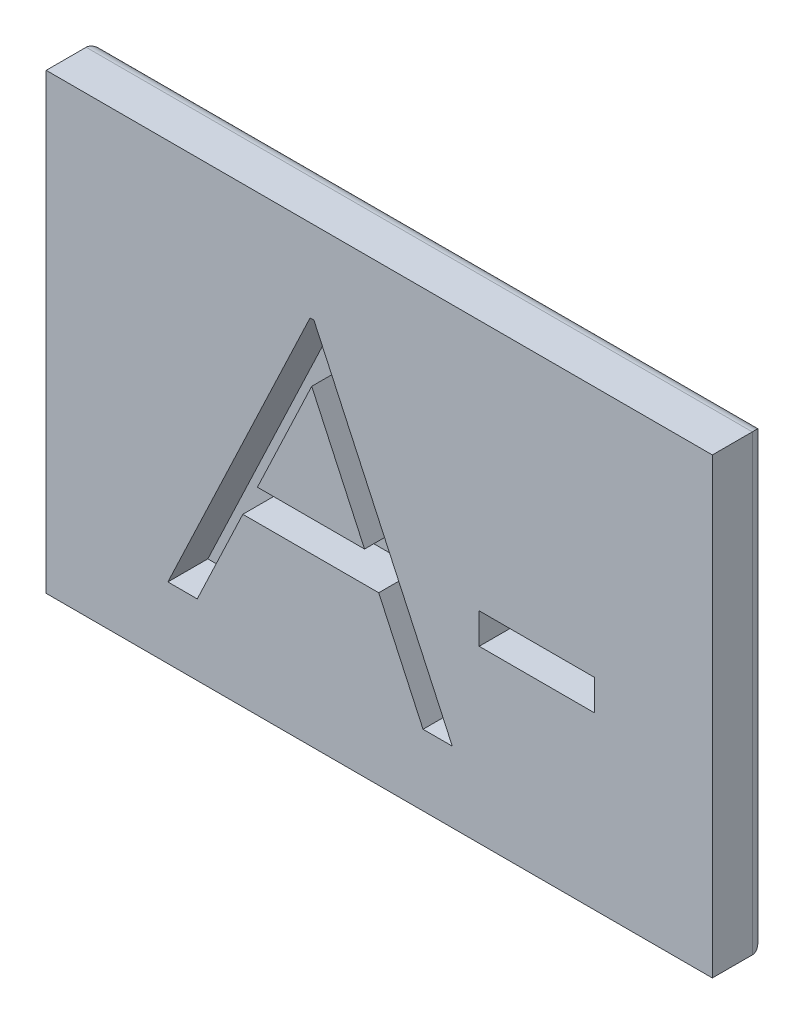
ISO-10303-21;
HEADER;
FILE_DESCRIPTION(('STEP AP214'),'2;1');
FILE_NAME('part.step','',(''),(''),'','','');
FILE_SCHEMA(('AUTOMOTIVE_DESIGN { 1 0 10303 214 1 1 1 1 }'));
ENDSEC;
DATA;
#1=APPLICATION_CONTEXT('core data for automotive mechanical design processes');
#2=APPLICATION_PROTOCOL_DEFINITION('international standard','automotive_design',2000,#1);
#3=PRODUCT_CONTEXT('',#1,'mechanical');
#4=PRODUCT('Part','Part','',(#3));
#5=PRODUCT_RELATED_PRODUCT_CATEGORY('part','',(#4));
#6=PRODUCT_DEFINITION_FORMATION('','',#4);
#7=PRODUCT_DEFINITION_CONTEXT('part definition',#1,'design');
#8=PRODUCT_DEFINITION('design','',#6,#7);
#9=PRODUCT_DEFINITION_SHAPE('','',#8);
#10=(LENGTH_UNIT() NAMED_UNIT(*) SI_UNIT(.MILLI.,.METRE.));
#11=(NAMED_UNIT(*) PLANE_ANGLE_UNIT() SI_UNIT($,.RADIAN.));
#12=(NAMED_UNIT(*) SI_UNIT($,.STERADIAN.) SOLID_ANGLE_UNIT());
#13=UNCERTAINTY_MEASURE_WITH_UNIT(LENGTH_MEASURE(1.E-05),#10,'distance_accuracy_value','');
#14=(GEOMETRIC_REPRESENTATION_CONTEXT(3) GLOBAL_UNCERTAINTY_ASSIGNED_CONTEXT((#13)) GLOBAL_UNIT_ASSIGNED_CONTEXT((#10,
#11,#12)) REPRESENTATION_CONTEXT('',''));
#15=CARTESIAN_POINT('',(0.,0.,0.));
#16=DIRECTION('',(0.,0.,1.));
#17=DIRECTION('',(1.,0.,0.));
#18=AXIS2_PLACEMENT_3D('',#15,#16,#17);
#19=CARTESIAN_POINT('',(0.,0.,2.54));
#20=DIRECTION('',(0.,0.,-1.));
#21=DIRECTION('',(-1.,0.,0.));
#22=AXIS2_PLACEMENT_3D('',#19,#20,#21);
#23=PLANE('',#22);
#24=DIRECTION('',(0.,1.,0.));
#25=VECTOR('',#24,1.);
#26=CARTESIAN_POINT('',(4.7625,-2.66023079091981,2.54));
#27=LINE('',#26,#25);
#28=CARTESIAN_POINT('',(4.7625,-2.66023079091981,2.54));
#29=VERTEX_POINT('',#28);
#30=CARTESIAN_POINT('',(4.7625,-1.19484617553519,2.54));
#31=VERTEX_POINT('',#30);
#32=EDGE_CURVE('E322',#29,#31,#27,.T.);
#33=ORIENTED_EDGE('',*,*,#32,.T.);
#34=DIRECTION('',(1.,0.,0.));
#35=VECTOR('',#34,1.);
#36=CARTESIAN_POINT('',(4.7625,-1.19484617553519,2.54));
#37=LINE('',#36,#35);
#38=CARTESIAN_POINT('',(10.2576923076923,-1.19484617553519,2.54));
#39=VERTEX_POINT('',#38);
#40=EDGE_CURVE('E326',#31,#39,#37,.T.);
#41=ORIENTED_EDGE('',*,*,#40,.T.);
#42=DIRECTION('',(0.,-1.,0.));
#43=VECTOR('',#42,1.);
#44=CARTESIAN_POINT('',(10.2576923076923,-1.19484617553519,2.54));
#45=LINE('',#44,#43);
#46=CARTESIAN_POINT('',(10.2576923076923,-2.66023079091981,2.54));
#47=VERTEX_POINT('',#46);
#48=EDGE_CURVE('E330',#39,#47,#45,.T.);
#49=ORIENTED_EDGE('',*,*,#48,.T.);
#50=DIRECTION('',(-1.,0.,0.));
#51=VECTOR('',#50,1.);
#52=CARTESIAN_POINT('',(10.2576923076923,-2.66023079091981,2.54));
#53=LINE('',#52,#51);
#54=EDGE_CURVE('E312',#47,#29,#53,.T.);
#55=ORIENTED_EDGE('',*,*,#54,.T.);
#56=EDGE_LOOP('',(#33,#41,#49,#55));
#57=FACE_BOUND('',#56,.T.);
#58=DIRECTION('',(0.,1.,0.));
#59=VECTOR('',#58,1.);
#60=CARTESIAN_POINT('',(15.875,-10.795,2.54));
#61=LINE('',#60,#59);
#62=CARTESIAN_POINT('',(15.875,-10.795,2.54));
#63=VERTEX_POINT('',#62);
#64=CARTESIAN_POINT('',(15.875,10.795,2.54));
#65=VERTEX_POINT('',#64);
#66=EDGE_CURVE('E349',#63,#65,#61,.T.);
#67=ORIENTED_EDGE('',*,*,#66,.T.);
#68=DIRECTION('',(-1.,0.,0.));
#69=VECTOR('',#68,1.);
#70=CARTESIAN_POINT('',(-15.875,10.795,2.54));
#71=LINE('',#70,#69);
#72=CARTESIAN_POINT('',(-15.875,10.795,2.54));
#73=VERTEX_POINT('',#72);
#74=EDGE_CURVE('E353',#65,#73,#71,.T.);
#75=ORIENTED_EDGE('',*,*,#74,.T.);
#76=DIRECTION('',(0.,-1.,0.));
#77=VECTOR('',#76,1.);
#78=CARTESIAN_POINT('',(-15.875,-10.795,2.54));
#79=LINE('',#78,#77);
#80=CARTESIAN_POINT('',(-15.875,-10.795,2.54));
#81=VERTEX_POINT('',#80);
#82=EDGE_CURVE('E356',#73,#81,#79,.T.);
#83=ORIENTED_EDGE('',*,*,#82,.T.);
#84=DIRECTION('',(1.,0.,0.));
#85=VECTOR('',#84,1.);
#86=CARTESIAN_POINT('',(-15.875,-10.795,2.54));
#87=LINE('',#86,#85);
#88=EDGE_CURVE('E359',#81,#63,#87,.T.);
#89=ORIENTED_EDGE('',*,*,#88,.T.);
#90=EDGE_LOOP('',(#67,#75,#83,#89));
#91=FACE_BOUND('',#90,.T.);
#92=DIRECTION('',(1.,0.,0.));
#93=VECTOR('',#92,1.);
#94=CARTESIAN_POINT('',(-3.29711538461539,6.86476920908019,2.54));
#95=LINE('',#94,#93);
#96=CARTESIAN_POINT('',(-3.29711538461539,6.86476920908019,2.54));
#97=VERTEX_POINT('',#96);
#98=CARTESIAN_POINT('',(-3.11394230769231,6.86476920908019,2.54));
#99=VERTEX_POINT('',#98);
#100=EDGE_CURVE('E56',#97,#99,#95,.T.);
#101=ORIENTED_EDGE('',*,*,#100,.T.);
#102=DIRECTION('',(0.419058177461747,-0.907959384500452,0.));
#103=VECTOR('',#102,1.);
#104=CARTESIAN_POINT('',(-3.11394230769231,6.86476920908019,2.54));
#105=LINE('',#104,#103);
#106=CARTESIAN_POINT('',(3.48028846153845,-7.42273079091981,2.54));
#107=VERTEX_POINT('',#106);
#108=EDGE_CURVE('E256',#99,#107,#105,.T.);
#109=ORIENTED_EDGE('',*,*,#108,.T.);
#110=DIRECTION('',(-1.,0.,0.));
#111=VECTOR('',#110,1.);
#112=CARTESIAN_POINT('',(3.48028846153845,-7.42273079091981,2.54));
#113=LINE('',#112,#111);
#114=CARTESIAN_POINT('',(2.08645582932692,-7.42273079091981,2.54));
#115=VERTEX_POINT('',#114);
#116=EDGE_CURVE('E260',#107,#115,#113,.T.);
#117=ORIENTED_EDGE('',*,*,#116,.T.);
#118=DIRECTION('',(-0.418842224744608,0.908059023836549,0.));
#119=VECTOR('',#118,1.);
#120=CARTESIAN_POINT('',(2.08645582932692,-7.42273079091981,2.54));
#121=LINE('',#120,#119);
#122=CARTESIAN_POINT('',(-0.025758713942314,-2.84340386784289,2.54));
#123=VERTEX_POINT('',#122);
#124=EDGE_CURVE('E264',#115,#123,#121,.T.);
#125=ORIENTED_EDGE('',*,*,#124,.T.);
#126=DIRECTION('',(-1.,0.,0.));
#127=VECTOR('',#126,1.);
#128=CARTESIAN_POINT('',(-0.025758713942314,-2.84340386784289,2.54));
#129=LINE('',#128,#127);
#130=CARTESIAN_POINT('',(-6.50264423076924,-2.84340386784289,2.54));
#131=VERTEX_POINT('',#130);
#132=EDGE_CURVE('E268',#123,#131,#129,.T.);
#133=ORIENTED_EDGE('',*,*,#132,.T.);
#134=DIRECTION('',(-0.428596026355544,-0.903496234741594,0.));
#135=VECTOR('',#134,1.);
#136=CARTESIAN_POINT('',(-6.50264423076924,-2.84340386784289,2.54));
#137=LINE('',#136,#135);
#138=CARTESIAN_POINT('',(-8.67496243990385,-7.42273079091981,2.54));
#139=VERTEX_POINT('',#138);
#140=EDGE_CURVE('E272',#131,#139,#137,.T.);
#141=ORIENTED_EDGE('',*,*,#140,.T.);
#142=DIRECTION('',(-1.,0.,0.));
#143=VECTOR('',#142,1.);
#144=CARTESIAN_POINT('',(-8.67496243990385,-7.42273079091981,2.54));
#145=LINE('',#144,#143);
#146=CARTESIAN_POINT('',(-10.0745192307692,-7.42273079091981,2.54));
#147=VERTEX_POINT('',#146);
#148=EDGE_CURVE('E276',#139,#147,#145,.T.);
#149=ORIENTED_EDGE('',*,*,#148,.T.);
#150=DIRECTION('',(0.428584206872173,0.903501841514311,0.));
#151=VECTOR('',#150,1.);
#152=CARTESIAN_POINT('',(-10.0745192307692,-7.42273079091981,2.54));
#153=LINE('',#152,#151);
#154=EDGE_CURVE('E232',#147,#97,#153,.T.);
#155=ORIENTED_EDGE('',*,*,#154,.T.);
#156=EDGE_LOOP('',(#101,#109,#117,#125,#133,#141,#149,#155));
#157=FACE_BOUND('',#156,.T.);
#158=ADVANCED_FACE('F38',(#57,#91,#157),#23,.F.);
#159=CARTESIAN_POINT('',(15.875,-10.795,2.54));
#160=DIRECTION('',(-1.,0.,0.));
#161=DIRECTION('',(0.,0.,1.));
#162=AXIS2_PLACEMENT_3D('',#159,#160,#161);
#163=PLANE('',#162);
#164=DIRECTION('',(0.,0.,-1.));
#165=VECTOR('',#164,1.);
#166=CARTESIAN_POINT('',(15.875,-10.795,2.54));
#167=LINE('',#166,#165);
#168=CARTESIAN_POINT('',(15.875,-10.795,0.635));
#169=VERTEX_POINT('',#168);
#170=EDGE_CURVE('E362',#63,#169,#167,.T.);
#171=ORIENTED_EDGE('',*,*,#170,.T.);
#172=DIRECTION('',(0.,1.,0.));
#173=VECTOR('',#172,1.);
#174=CARTESIAN_POINT('',(15.875,10.795,0.635));
#175=LINE('',#174,#173);
#176=CARTESIAN_POINT('',(15.875,10.795,0.635));
#177=VERTEX_POINT('',#176);
#178=EDGE_CURVE('E11',#169,#177,#175,.T.);
#179=ORIENTED_EDGE('',*,*,#178,.T.);
#180=DIRECTION('',(0.,0.,-1.));
#181=VECTOR('',#180,1.);
#182=CARTESIAN_POINT('',(15.875,10.795,2.54));
#183=LINE('',#182,#181);
#184=EDGE_CURVE('E374',#65,#177,#183,.T.);
#185=ORIENTED_EDGE('',*,*,#184,.F.);
#186=ORIENTED_EDGE('',*,*,#66,.F.);
#187=EDGE_LOOP('',(#171,#179,#185,#186));
#188=FACE_BOUND('',#187,.T.);
#189=ADVANCED_FACE('F446',(#188),#163,.F.);
#190=CARTESIAN_POINT('',(-15.875,10.795,2.54));
#191=DIRECTION('',(0.,-1.,0.));
#192=DIRECTION('',(0.,0.,-1.));
#193=AXIS2_PLACEMENT_3D('',#190,#191,#192);
#194=PLANE('',#193);
#195=ORIENTED_EDGE('',*,*,#184,.T.);
#196=DIRECTION('',(-1.,0.,0.));
#197=VECTOR('',#196,1.);
#198=CARTESIAN_POINT('',(-15.875,10.795,0.635));
#199=LINE('',#198,#197);
#200=CARTESIAN_POINT('',(-15.875,10.795,0.635));
#201=VERTEX_POINT('',#200);
#202=EDGE_CURVE('E48',#177,#201,#199,.T.);
#203=ORIENTED_EDGE('',*,*,#202,.T.);
#204=DIRECTION('',(0.,0.,-1.));
#205=VECTOR('',#204,1.);
#206=CARTESIAN_POINT('',(-15.875,10.795,2.54));
#207=LINE('',#206,#205);
#208=EDGE_CURVE('E370',#73,#201,#207,.T.);
#209=ORIENTED_EDGE('',*,*,#208,.F.);
#210=ORIENTED_EDGE('',*,*,#74,.F.);
#211=EDGE_LOOP('',(#195,#203,#209,#210));
#212=FACE_BOUND('',#211,.T.);
#213=ADVANCED_FACE('F444',(#212),#194,.F.);
#214=CARTESIAN_POINT('',(-15.875,-10.795,2.54));
#215=DIRECTION('',(1.,0.,0.));
#216=DIRECTION('',(0.,0.,-1.));
#217=AXIS2_PLACEMENT_3D('',#214,#215,#216);
#218=PLANE('',#217);
#219=ORIENTED_EDGE('',*,*,#208,.T.);
#220=DIRECTION('',(0.,-1.,0.));
#221=VECTOR('',#220,1.);
#222=CARTESIAN_POINT('',(-15.875,-10.795,0.635));
#223=LINE('',#222,#221);
#224=CARTESIAN_POINT('',(-15.875,-10.795,0.635));
#225=VERTEX_POINT('',#224);
#226=EDGE_CURVE('E378',#201,#225,#223,.T.);
#227=ORIENTED_EDGE('',*,*,#226,.T.);
#228=DIRECTION('',(0.,0.,-1.));
#229=VECTOR('',#228,1.);
#230=CARTESIAN_POINT('',(-15.875,-10.795,2.54));
#231=LINE('',#230,#229);
#232=EDGE_CURVE('E366',#81,#225,#231,.T.);
#233=ORIENTED_EDGE('',*,*,#232,.F.);
#234=ORIENTED_EDGE('',*,*,#82,.F.);
#235=EDGE_LOOP('',(#219,#227,#233,#234));
#236=FACE_BOUND('',#235,.T.);
#237=ADVANCED_FACE('F434',(#236),#218,.F.);
#238=CARTESIAN_POINT('',(-15.875,-10.795,2.54));
#239=DIRECTION('',(0.,1.,0.));
#240=DIRECTION('',(0.,0.,1.));
#241=AXIS2_PLACEMENT_3D('',#238,#239,#240);
#242=PLANE('',#241);
#243=ORIENTED_EDGE('',*,*,#232,.T.);
#244=DIRECTION('',(1.,0.,0.));
#245=VECTOR('',#244,1.);
#246=CARTESIAN_POINT('',(15.875,-10.795,0.635));
#247=LINE('',#246,#245);
#248=EDGE_CURVE('E395',#225,#169,#247,.T.);
#249=ORIENTED_EDGE('',*,*,#248,.T.);
#250=ORIENTED_EDGE('',*,*,#170,.F.);
#251=ORIENTED_EDGE('',*,*,#88,.F.);
#252=EDGE_LOOP('',(#243,#249,#250,#251));
#253=FACE_BOUND('',#252,.T.);
#254=ADVANCED_FACE('F438',(#253),#242,.F.);
#255=CARTESIAN_POINT('',(0.,0.,0.));
#256=DIRECTION('',(0.,0.,-1.));
#257=DIRECTION('',(-1.,0.,0.));
#258=AXIS2_PLACEMENT_3D('',#255,#256,#257);
#259=PLANE('',#258);
#260=DIRECTION('',(1.,0.,0.));
#261=VECTOR('',#260,1.);
#262=CARTESIAN_POINT('',(-15.875,-10.16,0.));
#263=LINE('',#262,#261);
#264=CARTESIAN_POINT('',(15.24,-10.16,0.));
#265=VERTEX_POINT('',#264);
#266=CARTESIAN_POINT('',(-15.24,-10.16,0.));
#267=VERTEX_POINT('',#266);
#268=EDGE_CURVE('E388',#265,#267,#263,.F.);
#269=ORIENTED_EDGE('',*,*,#268,.T.);
#270=DIRECTION('',(0.,-1.,0.));
#271=VECTOR('',#270,1.);
#272=CARTESIAN_POINT('',(-15.24,10.795,0.));
#273=LINE('',#272,#271);
#274=CARTESIAN_POINT('',(-15.24,10.16,0.));
#275=VERTEX_POINT('',#274);
#276=EDGE_CURVE('E391',#267,#275,#273,.F.);
#277=ORIENTED_EDGE('',*,*,#276,.T.);
#278=DIRECTION('',(-1.,0.,0.));
#279=VECTOR('',#278,1.);
#280=CARTESIAN_POINT('',(15.875,10.16,0.));
#281=LINE('',#280,#279);
#282=CARTESIAN_POINT('',(15.24,10.16,0.));
#283=VERTEX_POINT('',#282);
#284=EDGE_CURVE('E385',#275,#283,#281,.F.);
#285=ORIENTED_EDGE('',*,*,#284,.T.);
#286=DIRECTION('',(0.,1.,0.));
#287=VECTOR('',#286,1.);
#288=CARTESIAN_POINT('',(15.24,-10.795,0.));
#289=LINE('',#288,#287);
#290=EDGE_CURVE('E382',#283,#265,#289,.F.);
#291=ORIENTED_EDGE('',*,*,#290,.T.);
#292=EDGE_LOOP('',(#269,#277,#285,#291));
#293=FACE_BOUND('',#292,.T.);
#294=ADVANCED_FACE('F423',(#293),#259,.T.);
#295=CARTESIAN_POINT('',(15.24,-10.795,0.635));
#296=DIRECTION('',(0.,-1.,0.));
#297=DIRECTION('',(0.,0.,-1.));
#298=AXIS2_PLACEMENT_3D('',#295,#296,#297);
#299=CYLINDRICAL_SURFACE('',#298,0.635);
#300=CARTESIAN_POINT('',(15.24,-10.16,0.635));
#301=DIRECTION('',(-0.707106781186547,-0.707106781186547,0.));
#302=DIRECTION('',(0.707106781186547,-0.707106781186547,0.));
#303=AXIS2_PLACEMENT_3D('',#300,#301,#302);
#304=ELLIPSE('',#303,0.898025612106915,0.635);
#305=EDGE_CURVE('E404',#265,#169,#304,.T.);
#306=ORIENTED_EDGE('',*,*,#305,.F.);
#307=ORIENTED_EDGE('',*,*,#290,.F.);
#308=CARTESIAN_POINT('',(15.24,10.16,0.635));
#309=DIRECTION('',(0.707106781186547,-0.707106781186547,0.));
#310=DIRECTION('',(-0.707106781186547,-0.707106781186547,0.));
#311=AXIS2_PLACEMENT_3D('',#308,#309,#310);
#312=ELLIPSE('',#311,0.898025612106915,0.635);
#313=EDGE_CURVE('E42',#177,#283,#312,.F.);
#314=ORIENTED_EDGE('',*,*,#313,.F.);
#315=ORIENTED_EDGE('',*,*,#178,.F.);
#316=EDGE_LOOP('',(#306,#307,#314,#315));
#317=FACE_BOUND('',#316,.T.);
#318=ADVANCED_FACE('F40',(#317),#299,.T.);
#319=CARTESIAN_POINT('',(-15.875,10.16,0.635));
#320=DIRECTION('',(1.,0.,0.));
#321=DIRECTION('',(0.,0.,-1.));
#322=AXIS2_PLACEMENT_3D('',#319,#320,#321);
#323=CYLINDRICAL_SURFACE('',#322,0.635);
#324=ORIENTED_EDGE('',*,*,#313,.T.);
#325=ORIENTED_EDGE('',*,*,#284,.F.);
#326=CARTESIAN_POINT('',(-15.24,10.16,0.635));
#327=DIRECTION('',(0.707106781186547,0.707106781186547,0.));
#328=DIRECTION('',(0.707106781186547,-0.707106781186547,0.));
#329=AXIS2_PLACEMENT_3D('',#326,#327,#328);
#330=ELLIPSE('',#329,0.898025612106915,0.635);
#331=EDGE_CURVE('E402',#201,#275,#330,.F.);
#332=ORIENTED_EDGE('',*,*,#331,.F.);
#333=ORIENTED_EDGE('',*,*,#202,.F.);
#334=EDGE_LOOP('',(#324,#325,#332,#333));
#335=FACE_BOUND('',#334,.T.);
#336=ADVANCED_FACE('F417',(#335),#323,.T.);
#337=CARTESIAN_POINT('',(-15.875,-10.16,0.635));
#338=DIRECTION('',(-1.,0.,0.));
#339=DIRECTION('',(0.,0.,1.));
#340=AXIS2_PLACEMENT_3D('',#337,#338,#339);
#341=CYLINDRICAL_SURFACE('',#340,0.635);
#342=ORIENTED_EDGE('',*,*,#305,.T.);
#343=ORIENTED_EDGE('',*,*,#248,.F.);
#344=CARTESIAN_POINT('',(-15.24,-10.16,0.635));
#345=DIRECTION('',(-0.707106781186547,0.707106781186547,0.));
#346=DIRECTION('',(-0.707106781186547,-0.707106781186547,0.));
#347=AXIS2_PLACEMENT_3D('',#344,#345,#346);
#348=ELLIPSE('',#347,0.898025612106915,0.635);
#349=EDGE_CURVE('E306',#267,#225,#348,.T.);
#350=ORIENTED_EDGE('',*,*,#349,.F.);
#351=ORIENTED_EDGE('',*,*,#268,.F.);
#352=EDGE_LOOP('',(#342,#343,#350,#351));
#353=FACE_BOUND('',#352,.T.);
#354=ADVANCED_FACE('F429',(#353),#341,.T.);
#355=CARTESIAN_POINT('',(-15.24,-10.795,0.635));
#356=DIRECTION('',(0.,1.,0.));
#357=DIRECTION('',(0.,0.,1.));
#358=AXIS2_PLACEMENT_3D('',#355,#356,#357);
#359=CYLINDRICAL_SURFACE('',#358,0.635);
#360=ORIENTED_EDGE('',*,*,#331,.T.);
#361=ORIENTED_EDGE('',*,*,#276,.F.);
#362=ORIENTED_EDGE('',*,*,#349,.T.);
#363=ORIENTED_EDGE('',*,*,#226,.F.);
#364=EDGE_LOOP('',(#360,#361,#362,#363));
#365=FACE_BOUND('',#364,.T.);
#366=ADVANCED_FACE('F427',(#365),#359,.T.);
#367=CARTESIAN_POINT('',(4.7625,-2.66023079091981,0.635));
#368=DIRECTION('',(1.,0.,0.));
#369=DIRECTION('',(0.,0.,-1.));
#370=AXIS2_PLACEMENT_3D('',#367,#368,#369);
#371=PLANE('',#370);
#372=ORIENTED_EDGE('',*,*,#32,.F.);
#373=DIRECTION('',(0.,0.,1.));
#374=VECTOR('',#373,1.);
#375=CARTESIAN_POINT('',(4.7625,-2.66023079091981,0.635));
#376=LINE('',#375,#374);
#377=CARTESIAN_POINT('',(4.7625,-2.66023079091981,0.635));
#378=VERTEX_POINT('',#377);
#379=EDGE_CURVE('E321',#378,#29,#376,.T.);
#380=ORIENTED_EDGE('',*,*,#379,.F.);
#381=DIRECTION('',(0.,1.,0.));
#382=VECTOR('',#381,1.);
#383=CARTESIAN_POINT('',(4.7625,-2.66023079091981,0.635));
#384=LINE('',#383,#382);
#385=CARTESIAN_POINT('',(4.7625,-1.19484617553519,0.635));
#386=VERTEX_POINT('',#385);
#387=EDGE_CURVE('E307',#378,#386,#384,.T.);
#388=ORIENTED_EDGE('',*,*,#387,.T.);
#389=DIRECTION('',(0.,0.,1.));
#390=VECTOR('',#389,1.);
#391=CARTESIAN_POINT('',(4.7625,-1.19484617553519,0.635));
#392=LINE('',#391,#390);
#393=EDGE_CURVE('E220',#386,#31,#392,.T.);
#394=ORIENTED_EDGE('',*,*,#393,.T.);
#395=EDGE_LOOP('',(#372,#380,#388,#394));
#396=FACE_BOUND('',#395,.T.);
#397=ADVANCED_FACE('F461',(#396),#371,.T.);
#398=CARTESIAN_POINT('',(4.7625,-1.19484617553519,0.635));
#399=DIRECTION('',(0.,-1.,0.));
#400=DIRECTION('',(0.,0.,-1.));
#401=AXIS2_PLACEMENT_3D('',#398,#399,#400);
#402=PLANE('',#401);
#403=ORIENTED_EDGE('',*,*,#40,.F.);
#404=ORIENTED_EDGE('',*,*,#393,.F.);
#405=DIRECTION('',(1.,0.,0.));
#406=VECTOR('',#405,1.);
#407=CARTESIAN_POINT('',(4.7625,-1.19484617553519,0.635));
#408=LINE('',#407,#406);
#409=CARTESIAN_POINT('',(10.2576923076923,-1.19484617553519,0.635));
#410=VERTEX_POINT('',#409);
#411=EDGE_CURVE('E311',#386,#410,#408,.T.);
#412=ORIENTED_EDGE('',*,*,#411,.T.);
#413=DIRECTION('',(0.,0.,1.));
#414=VECTOR('',#413,1.);
#415=CARTESIAN_POINT('',(10.2576923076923,-1.19484617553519,0.635));
#416=LINE('',#415,#414);
#417=EDGE_CURVE('E343',#410,#39,#416,.T.);
#418=ORIENTED_EDGE('',*,*,#417,.T.);
#419=EDGE_LOOP('',(#403,#404,#412,#418));
#420=FACE_BOUND('',#419,.T.);
#421=ADVANCED_FACE('F524',(#420),#402,.T.);
#422=CARTESIAN_POINT('',(10.2576923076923,-1.19484617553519,0.635));
#423=DIRECTION('',(-1.,0.,0.));
#424=DIRECTION('',(0.,0.,1.));
#425=AXIS2_PLACEMENT_3D('',#422,#423,#424);
#426=PLANE('',#425);
#427=ORIENTED_EDGE('',*,*,#48,.F.);
#428=ORIENTED_EDGE('',*,*,#417,.F.);
#429=DIRECTION('',(0.,-1.,0.));
#430=VECTOR('',#429,1.);
#431=CARTESIAN_POINT('',(10.2576923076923,-1.19484617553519,0.635));
#432=LINE('',#431,#430);
#433=CARTESIAN_POINT('',(10.2576923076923,-2.66023079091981,0.635));
#434=VERTEX_POINT('',#433);
#435=EDGE_CURVE('E315',#410,#434,#432,.T.);
#436=ORIENTED_EDGE('',*,*,#435,.T.);
#437=DIRECTION('',(0.,0.,1.));
#438=VECTOR('',#437,1.);
#439=CARTESIAN_POINT('',(10.2576923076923,-2.66023079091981,0.635));
#440=LINE('',#439,#438);
#441=EDGE_CURVE('E340',#434,#47,#440,.T.);
#442=ORIENTED_EDGE('',*,*,#441,.T.);
#443=EDGE_LOOP('',(#427,#428,#436,#442));
#444=FACE_BOUND('',#443,.T.);
#445=ADVANCED_FACE('F533',(#444),#426,.T.);
#446=CARTESIAN_POINT('',(10.2576923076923,-2.66023079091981,0.635));
#447=DIRECTION('',(0.,1.,0.));
#448=DIRECTION('',(0.,0.,1.));
#449=AXIS2_PLACEMENT_3D('',#446,#447,#448);
#450=PLANE('',#449);
#451=ORIENTED_EDGE('',*,*,#54,.F.);
#452=ORIENTED_EDGE('',*,*,#441,.F.);
#453=DIRECTION('',(-1.,0.,0.));
#454=VECTOR('',#453,1.);
#455=CARTESIAN_POINT('',(10.2576923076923,-2.66023079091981,0.635));
#456=LINE('',#455,#454);
#457=EDGE_CURVE('E318',#434,#378,#456,.T.);
#458=ORIENTED_EDGE('',*,*,#457,.T.);
#459=ORIENTED_EDGE('',*,*,#379,.T.);
#460=EDGE_LOOP('',(#451,#452,#458,#459));
#461=FACE_BOUND('',#460,.T.);
#462=ADVANCED_FACE('F543',(#461),#450,.T.);
#463=CARTESIAN_POINT('',(0.,0.,0.635));
#464=DIRECTION('',(0.,0.,-1.));
#465=DIRECTION('',(-1.,0.,0.));
#466=AXIS2_PLACEMENT_3D('',#463,#464,#465);
#467=PLANE('',#466);
#468=ORIENTED_EDGE('',*,*,#387,.F.);
#469=ORIENTED_EDGE('',*,*,#457,.F.);
#470=ORIENTED_EDGE('',*,*,#435,.F.);
#471=ORIENTED_EDGE('',*,*,#411,.F.);
#472=EDGE_LOOP('',(#468,#469,#470,#471));
#473=FACE_BOUND('',#472,.T.);
#474=ADVANCED_FACE('F553',(#473),#467,.F.);
#475=CARTESIAN_POINT('',(-3.29711538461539,6.86476920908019,0.635));
#476=DIRECTION('',(0.,-1.,0.));
#477=DIRECTION('',(0.,0.,-1.));
#478=AXIS2_PLACEMENT_3D('',#475,#476,#477);
#479=PLANE('',#478);
#480=ORIENTED_EDGE('',*,*,#100,.F.);
#481=DIRECTION('',(0.,0.,1.));
#482=VECTOR('',#481,1.);
#483=CARTESIAN_POINT('',(-3.29711538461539,6.86476920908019,0.635));
#484=LINE('',#483,#482);
#485=CARTESIAN_POINT('',(-3.29711538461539,6.86476920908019,0.635));
#486=VERTEX_POINT('',#485);
#487=EDGE_CURVE('E253',#486,#97,#484,.T.);
#488=ORIENTED_EDGE('',*,*,#487,.F.);
#489=DIRECTION('',(1.,0.,0.));
#490=VECTOR('',#489,1.);
#491=CARTESIAN_POINT('',(-3.29711538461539,6.86476920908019,0.635));
#492=LINE('',#491,#490);
#493=CARTESIAN_POINT('',(-3.11394230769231,6.86476920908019,0.635));
#494=VERTEX_POINT('',#493);
#495=EDGE_CURVE('E227',#486,#494,#492,.T.);
#496=ORIENTED_EDGE('',*,*,#495,.T.);
#497=DIRECTION('',(0.,0.,1.));
#498=VECTOR('',#497,1.);
#499=CARTESIAN_POINT('',(-3.11394230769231,6.86476920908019,0.635));
#500=LINE('',#499,#498);
#501=EDGE_CURVE('E303',#494,#99,#500,.T.);
#502=ORIENTED_EDGE('',*,*,#501,.T.);
#503=EDGE_LOOP('',(#480,#488,#496,#502));
#504=FACE_BOUND('',#503,.T.);
#505=ADVANCED_FACE('F564',(#504),#479,.T.);
#506=CARTESIAN_POINT('',(-3.11394230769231,6.86476920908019,0.635));
#507=DIRECTION('',(-0.907959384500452,-0.419058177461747,0.));
#508=DIRECTION('',(0.419058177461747,-0.907959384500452,0.));
#509=AXIS2_PLACEMENT_3D('',#506,#507,#508);
#510=PLANE('',#509);
#511=ORIENTED_EDGE('',*,*,#108,.F.);
#512=ORIENTED_EDGE('',*,*,#501,.F.);
#513=DIRECTION('',(0.419058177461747,-0.907959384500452,0.));
#514=VECTOR('',#513,1.);
#515=CARTESIAN_POINT('',(-3.11394230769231,6.86476920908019,0.635));
#516=LINE('',#515,#514);
#517=CARTESIAN_POINT('',(3.48028846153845,-7.42273079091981,0.635));
#518=VERTEX_POINT('',#517);
#519=EDGE_CURVE('E231',#494,#518,#516,.T.);
#520=ORIENTED_EDGE('',*,*,#519,.T.);
#521=DIRECTION('',(0.,0.,1.));
#522=VECTOR('',#521,1.);
#523=CARTESIAN_POINT('',(3.48028846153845,-7.42273079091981,0.635));
#524=LINE('',#523,#522);
#525=EDGE_CURVE('E300',#518,#107,#524,.T.);
#526=ORIENTED_EDGE('',*,*,#525,.T.);
#527=EDGE_LOOP('',(#511,#512,#520,#526));
#528=FACE_BOUND('',#527,.T.);
#529=ADVANCED_FACE('F575',(#528),#510,.T.);
#530=CARTESIAN_POINT('',(3.48028846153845,-7.42273079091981,0.635));
#531=DIRECTION('',(0.,1.,0.));
#532=DIRECTION('',(0.,0.,1.));
#533=AXIS2_PLACEMENT_3D('',#530,#531,#532);
#534=PLANE('',#533);
#535=ORIENTED_EDGE('',*,*,#116,.F.);
#536=ORIENTED_EDGE('',*,*,#525,.F.);
#537=DIRECTION('',(-1.,0.,0.));
#538=VECTOR('',#537,1.);
#539=CARTESIAN_POINT('',(3.48028846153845,-7.42273079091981,0.635));
#540=LINE('',#539,#538);
#541=CARTESIAN_POINT('',(2.08645582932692,-7.42273079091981,0.635));
#542=VERTEX_POINT('',#541);
#543=EDGE_CURVE('E235',#518,#542,#540,.T.);
#544=ORIENTED_EDGE('',*,*,#543,.T.);
#545=DIRECTION('',(0.,0.,1.));
#546=VECTOR('',#545,1.);
#547=CARTESIAN_POINT('',(2.08645582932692,-7.42273079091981,0.635));
#548=LINE('',#547,#546);
#549=EDGE_CURVE('E297',#542,#115,#548,.T.);
#550=ORIENTED_EDGE('',*,*,#549,.T.);
#551=EDGE_LOOP('',(#535,#536,#544,#550));
#552=FACE_BOUND('',#551,.T.);
#553=ADVANCED_FACE('F584',(#552),#534,.T.);
#554=CARTESIAN_POINT('',(2.08645582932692,-7.42273079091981,0.635));
#555=DIRECTION('',(0.908059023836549,0.418842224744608,0.));
#556=DIRECTION('',(-0.418842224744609,0.908059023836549,0.));
#557=AXIS2_PLACEMENT_3D('',#554,#555,#556);
#558=PLANE('',#557);
#559=ORIENTED_EDGE('',*,*,#124,.F.);
#560=ORIENTED_EDGE('',*,*,#549,.F.);
#561=DIRECTION('',(-0.418842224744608,0.908059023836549,0.));
#562=VECTOR('',#561,1.);
#563=CARTESIAN_POINT('',(2.08645582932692,-7.42273079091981,0.635));
#564=LINE('',#563,#562);
#565=CARTESIAN_POINT('',(-0.025758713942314,-2.84340386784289,0.635));
#566=VERTEX_POINT('',#565);
#567=EDGE_CURVE('E238',#542,#566,#564,.T.);
#568=ORIENTED_EDGE('',*,*,#567,.T.);
#569=DIRECTION('',(0.,0.,1.));
#570=VECTOR('',#569,1.);
#571=CARTESIAN_POINT('',(-0.025758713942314,-2.84340386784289,0.635));
#572=LINE('',#571,#570);
#573=EDGE_CURVE('E294',#566,#123,#572,.T.);
#574=ORIENTED_EDGE('',*,*,#573,.T.);
#575=EDGE_LOOP('',(#559,#560,#568,#574));
#576=FACE_BOUND('',#575,.T.);
#577=ADVANCED_FACE('F594',(#576),#558,.T.);
#578=CARTESIAN_POINT('',(-0.025758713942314,-2.84340386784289,0.635));
#579=DIRECTION('',(0.,1.,0.));
#580=DIRECTION('',(0.,0.,1.));
#581=AXIS2_PLACEMENT_3D('',#578,#579,#580);
#582=PLANE('',#581);
#583=ORIENTED_EDGE('',*,*,#132,.F.);
#584=ORIENTED_EDGE('',*,*,#573,.F.);
#585=DIRECTION('',(-1.,0.,0.));
#586=VECTOR('',#585,1.);
#587=CARTESIAN_POINT('',(-0.025758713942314,-2.84340386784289,0.635));
#588=LINE('',#587,#586);
#589=CARTESIAN_POINT('',(-6.50264423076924,-2.84340386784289,0.635));
#590=VERTEX_POINT('',#589);
#591=EDGE_CURVE('E241',#566,#590,#588,.T.);
#592=ORIENTED_EDGE('',*,*,#591,.T.);
#593=DIRECTION('',(0.,0.,1.));
#594=VECTOR('',#593,1.);
#595=CARTESIAN_POINT('',(-6.50264423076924,-2.84340386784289,0.635));
#596=LINE('',#595,#594);
#597=EDGE_CURVE('E291',#590,#131,#596,.T.);
#598=ORIENTED_EDGE('',*,*,#597,.T.);
#599=EDGE_LOOP('',(#583,#584,#592,#598));
#600=FACE_BOUND('',#599,.T.);
#601=ADVANCED_FACE('F604',(#600),#582,.T.);
#602=CARTESIAN_POINT('',(-6.50264423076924,-2.84340386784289,0.635));
#603=DIRECTION('',(-0.903496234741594,0.428596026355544,0.));
#604=DIRECTION('',(-0.428596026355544,-0.903496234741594,0.));
#605=AXIS2_PLACEMENT_3D('',#602,#603,#604);
#606=PLANE('',#605);
#607=ORIENTED_EDGE('',*,*,#140,.F.);
#608=ORIENTED_EDGE('',*,*,#597,.F.);
#609=DIRECTION('',(-0.428596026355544,-0.903496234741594,0.));
#610=VECTOR('',#609,1.);
#611=CARTESIAN_POINT('',(-6.50264423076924,-2.84340386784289,0.635));
#612=LINE('',#611,#610);
#613=CARTESIAN_POINT('',(-8.67496243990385,-7.42273079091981,0.635));
#614=VERTEX_POINT('',#613);
#615=EDGE_CURVE('E244',#590,#614,#612,.T.);
#616=ORIENTED_EDGE('',*,*,#615,.T.);
#617=DIRECTION('',(0.,0.,1.));
#618=VECTOR('',#617,1.);
#619=CARTESIAN_POINT('',(-8.67496243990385,-7.42273079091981,0.635));
#620=LINE('',#619,#618);
#621=EDGE_CURVE('E288',#614,#139,#620,.T.);
#622=ORIENTED_EDGE('',*,*,#621,.T.);
#623=EDGE_LOOP('',(#607,#608,#616,#622));
#624=FACE_BOUND('',#623,.T.);
#625=ADVANCED_FACE('F614',(#624),#606,.T.);
#626=CARTESIAN_POINT('',(-8.67496243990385,-7.42273079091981,0.635));
#627=DIRECTION('',(0.,1.,0.));
#628=DIRECTION('',(0.,0.,1.));
#629=AXIS2_PLACEMENT_3D('',#626,#627,#628);
#630=PLANE('',#629);
#631=ORIENTED_EDGE('',*,*,#148,.F.);
#632=ORIENTED_EDGE('',*,*,#621,.F.);
#633=DIRECTION('',(-1.,0.,0.));
#634=VECTOR('',#633,1.);
#635=CARTESIAN_POINT('',(-8.67496243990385,-7.42273079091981,0.635));
#636=LINE('',#635,#634);
#637=CARTESIAN_POINT('',(-10.0745192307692,-7.42273079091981,0.635));
#638=VERTEX_POINT('',#637);
#639=EDGE_CURVE('E247',#614,#638,#636,.T.);
#640=ORIENTED_EDGE('',*,*,#639,.T.);
#641=DIRECTION('',(0.,0.,1.));
#642=VECTOR('',#641,1.);
#643=CARTESIAN_POINT('',(-10.0745192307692,-7.42273079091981,0.635));
#644=LINE('',#643,#642);
#645=EDGE_CURVE('E285',#638,#147,#644,.T.);
#646=ORIENTED_EDGE('',*,*,#645,.T.);
#647=EDGE_LOOP('',(#631,#632,#640,#646));
#648=FACE_BOUND('',#647,.T.);
#649=ADVANCED_FACE('F624',(#648),#630,.T.);
#650=CARTESIAN_POINT('',(-10.0745192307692,-7.42273079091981,0.635));
#651=DIRECTION('',(0.90350184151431,-0.428584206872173,0.));
#652=DIRECTION('',(0.428584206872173,0.903501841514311,0.));
#653=AXIS2_PLACEMENT_3D('',#650,#651,#652);
#654=PLANE('',#653);
#655=ORIENTED_EDGE('',*,*,#154,.F.);
#656=ORIENTED_EDGE('',*,*,#645,.F.);
#657=DIRECTION('',(0.428584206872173,0.903501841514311,0.));
#658=VECTOR('',#657,1.);
#659=CARTESIAN_POINT('',(-10.0745192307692,-7.42273079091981,0.635));
#660=LINE('',#659,#658);
#661=EDGE_CURVE('E250',#638,#486,#660,.T.);
#662=ORIENTED_EDGE('',*,*,#661,.T.);
#663=ORIENTED_EDGE('',*,*,#487,.T.);
#664=EDGE_LOOP('',(#655,#656,#662,#663));
#665=FACE_BOUND('',#664,.T.);
#666=ADVANCED_FACE('F634',(#665),#654,.T.);
#667=CARTESIAN_POINT('',(0.,0.,0.635));
#668=DIRECTION('',(0.,0.,1.));
#669=DIRECTION('',(1.,0.,0.));
#670=AXIS2_PLACEMENT_3D('',#667,#668,#669);
#671=PLANE('',#670);
#672=DIRECTION('',(1.,0.,0.));
#673=VECTOR('',#672,1.);
#674=CARTESIAN_POINT('',(-5.80715895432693,-1.37801925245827,0.635));
#675=LINE('',#674,#673);
#676=CARTESIAN_POINT('',(-5.80715895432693,-1.37801925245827,0.635));
#677=VERTEX_POINT('',#676);
#678=CARTESIAN_POINT('',(-0.70120943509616,-1.37801925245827,0.635));
#679=VERTEX_POINT('',#678);
#680=EDGE_CURVE('E198',#677,#679,#675,.T.);
#681=ORIENTED_EDGE('',*,*,#680,.F.);
#682=DIRECTION('',(-0.428351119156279,-0.903612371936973,0.));
#683=VECTOR('',#682,1.);
#684=CARTESIAN_POINT('',(-3.21983924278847,4.07996602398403,0.635));
#685=LINE('',#684,#683);
#686=CARTESIAN_POINT('',(-3.21983924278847,4.07996602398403,0.635));
#687=VERTEX_POINT('',#686);
#688=EDGE_CURVE('E189',#687,#677,#685,.T.);
#689=ORIENTED_EDGE('',*,*,#688,.F.);
#690=DIRECTION('',(-0.418997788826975,0.907987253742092,0.));
#691=VECTOR('',#690,1.);
#692=CARTESIAN_POINT('',(-0.70120943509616,-1.37801925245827,0.635));
#693=LINE('',#692,#691);
#694=EDGE_CURVE('E204',#679,#687,#693,.T.);
#695=ORIENTED_EDGE('',*,*,#694,.F.);
#696=EDGE_LOOP('',(#681,#689,#695));
#697=FACE_BOUND('',#696,.T.);
#698=ORIENTED_EDGE('',*,*,#495,.F.);
#699=ORIENTED_EDGE('',*,*,#661,.F.);
#700=ORIENTED_EDGE('',*,*,#639,.F.);
#701=ORIENTED_EDGE('',*,*,#615,.F.);
#702=ORIENTED_EDGE('',*,*,#591,.F.);
#703=ORIENTED_EDGE('',*,*,#567,.F.);
#704=ORIENTED_EDGE('',*,*,#543,.F.);
#705=ORIENTED_EDGE('',*,*,#519,.F.);
#706=EDGE_LOOP('',(#698,#699,#700,#701,#702,#703,#704,#705));
#707=FACE_BOUND('',#706,.T.);
#708=ADVANCED_FACE('F202',(#697,#707),#671,.T.);
#709=CARTESIAN_POINT('',(-0.70120943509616,-1.37801925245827,0.635));
#710=DIRECTION('',(0.907987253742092,0.418997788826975,0.));
#711=DIRECTION('',(-0.418997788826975,0.907987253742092,0.));
#712=AXIS2_PLACEMENT_3D('',#709,#710,#711);
#713=PLANE('',#712);
#714=DIRECTION('',(-0.418997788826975,0.907987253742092,0.));
#715=VECTOR('',#714,1.);
#716=CARTESIAN_POINT('',(-0.70120943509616,-1.37801925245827,2.54));
#717=LINE('',#716,#715);
#718=CARTESIAN_POINT('',(-0.70120943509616,-1.37801925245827,2.54));
#719=VERTEX_POINT('',#718);
#720=CARTESIAN_POINT('',(-3.21983924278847,4.07996602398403,2.54));
#721=VERTEX_POINT('',#720);
#722=EDGE_CURVE('E217',#719,#721,#717,.T.);
#723=ORIENTED_EDGE('',*,*,#722,.F.);
#724=DIRECTION('',(0.,0.,1.));
#725=VECTOR('',#724,1.);
#726=CARTESIAN_POINT('',(-0.70120943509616,-1.37801925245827,0.635));
#727=LINE('',#726,#725);
#728=EDGE_CURVE('E209',#679,#719,#727,.T.);
#729=ORIENTED_EDGE('',*,*,#728,.F.);
#730=ORIENTED_EDGE('',*,*,#694,.T.);
#731=DIRECTION('',(0.,0.,1.));
#732=VECTOR('',#731,1.);
#733=CARTESIAN_POINT('',(-3.21983924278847,4.07996602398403,0.635));
#734=LINE('',#733,#732);
#735=EDGE_CURVE('E186',#687,#721,#734,.T.);
#736=ORIENTED_EDGE('',*,*,#735,.T.);
#737=EDGE_LOOP('',(#723,#729,#730,#736));
#738=FACE_BOUND('',#737,.T.);
#739=ADVANCED_FACE('F208',(#738),#713,.T.);
#740=CARTESIAN_POINT('',(-5.80715895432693,-1.37801925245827,0.635));
#741=DIRECTION('',(0.,-1.,0.));
#742=DIRECTION('',(0.,0.,-1.));
#743=AXIS2_PLACEMENT_3D('',#740,#741,#742);
#744=PLANE('',#743);
#745=DIRECTION('',(1.,0.,0.));
#746=VECTOR('',#745,1.);
#747=CARTESIAN_POINT('',(-5.80715895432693,-1.37801925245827,2.54));
#748=LINE('',#747,#746);
#749=CARTESIAN_POINT('',(-5.80715895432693,-1.37801925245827,2.54));
#750=VERTEX_POINT('',#749);
#751=EDGE_CURVE('E64',#750,#719,#748,.T.);
#752=ORIENTED_EDGE('',*,*,#751,.F.);
#753=DIRECTION('',(0.,0.,1.));
#754=VECTOR('',#753,1.);
#755=CARTESIAN_POINT('',(-5.80715895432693,-1.37801925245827,0.635));
#756=LINE('',#755,#754);
#757=EDGE_CURVE('E197',#677,#750,#756,.T.);
#758=ORIENTED_EDGE('',*,*,#757,.F.);
#759=ORIENTED_EDGE('',*,*,#680,.T.);
#760=ORIENTED_EDGE('',*,*,#728,.T.);
#761=EDGE_LOOP('',(#752,#758,#759,#760));
#762=FACE_BOUND('',#761,.T.);
#763=ADVANCED_FACE('F661',(#762),#744,.T.);
#764=CARTESIAN_POINT('',(-3.21983924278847,4.07996602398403,0.635));
#765=DIRECTION('',(-0.903612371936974,0.428351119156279,0.));
#766=DIRECTION('',(-0.428351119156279,-0.903612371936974,0.));
#767=AXIS2_PLACEMENT_3D('',#764,#765,#766);
#768=PLANE('',#767);
#769=DIRECTION('',(-0.428351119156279,-0.903612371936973,0.));
#770=VECTOR('',#769,1.);
#771=CARTESIAN_POINT('',(-3.21983924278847,4.07996602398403,2.54));
#772=LINE('',#771,#770);
#773=EDGE_CURVE('E191',#721,#750,#772,.T.);
#774=ORIENTED_EDGE('',*,*,#773,.F.);
#775=ORIENTED_EDGE('',*,*,#735,.F.);
#776=ORIENTED_EDGE('',*,*,#688,.T.);
#777=ORIENTED_EDGE('',*,*,#757,.T.);
#778=EDGE_LOOP('',(#774,#775,#776,#777));
#779=FACE_BOUND('',#778,.T.);
#780=ADVANCED_FACE('F188',(#779),#768,.T.);
#781=ORIENTED_EDGE('',*,*,#722,.T.);
#782=ORIENTED_EDGE('',*,*,#773,.T.);
#783=ORIENTED_EDGE('',*,*,#751,.T.);
#784=EDGE_LOOP('',(#781,#782,#783));
#785=FACE_BOUND('',#784,.T.);
#786=ADVANCED_FACE('F456',(#785),#23,.F.);
#787=CLOSED_SHELL('',(#158,#189,#213,#237,#254,#294,#318,#336,#354,#366,#397,#421,#445,#462,
#474,#505,#529,#553,#577,#601,#625,#649,#666,#708,#739,#763,#780,#786));
#788=MANIFOLD_SOLID_BREP('B2',#787);
#789=ADVANCED_BREP_SHAPE_REPRESENTATION('',(#18,#788),#14);
#790=SHAPE_DEFINITION_REPRESENTATION(#9,#789);
ENDSEC;
END-ISO-10303-21;
